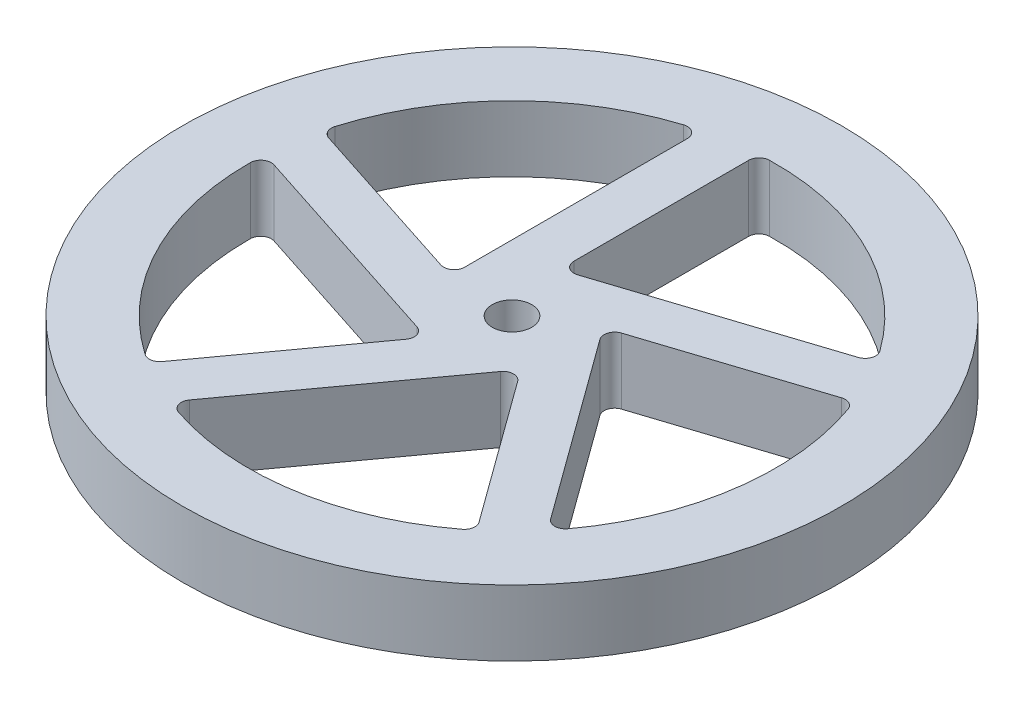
from build123d import *

# Parameters (mm, degrees)
SKETCH1_R             = 31.75
BOSS_EXTRUDE1_DEPTH   = 3.175
F_6_CLEARANCE_HOLE1_D = 3.7973
CUT_EXTRUDE1_DEPTH    = 6.35
FILLET1_R             = 1.016


with BuildPart() as part:
    # Sketch1 → Boss-Extrude1 (new, symmetric)
    with BuildSketch(Plane(origin=(0, 0, 0), x_dir=(1, 0, 0), z_dir=(0, 1, 0))):
        with Locations(Location((0, 0, 0), (0, 0, 270))):
            Circle(SKETCH1_R)
    extrude(amount=BOSS_EXTRUDE1_DEPTH, both=True)

    # 6 Clearance Hole1 (through all)
    with Locations(Plane(origin=(0, 3.175, 0), x_dir=(1, 0, 0), z_dir=(0, 1, 0))):
        with Locations((0, 0)):
            Hole(F_6_CLEARANCE_HOLE1_D / 2)

    # Sketch4 → Cut-Extrude1 (cut)
    with BuildSketch(Plane(origin=(0, 3.175, 0), x_dir=(1, 0, 0), z_dir=(0, 1, 0))):
        with BuildLine():
            Line((-24.600172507, 6.323884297), (-6.35, 0.39404379))
            Line((-6.35, 0.39404379), (-6.35, 24.593444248))
            ThreePointArc((-6.35, 24.593444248), (-17.970044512, 17.950974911), (-24.600172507, 6.323884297))
        make_face()
        with BuildLine():
            ThreePointArc((21.427497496, 13.639001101), (11.519342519, 22.637684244), (-1.5875, 25.350342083))
            Line((-1.5875, 25.350342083), (-1.5875, 6.160975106))
            Line((-1.5875, 6.160975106), (21.427497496, 13.639001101))
        make_face()
        with BuildLine():
            ThreePointArc((25.4, 0), (24.950788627, 4.755853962), (23.61904355, 9.343488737))
            Line((23.61904355, 9.343488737), (5.368871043, 3.413648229))
            Line((5.368871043, 3.413648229), (19.592921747, -16.164077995))
            ThreePointArc((19.592921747, -16.164077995), (23.904185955, -8.587775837), (25.4, 0))
        make_face()
        with BuildLine():
            Line((4.905644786, -4.051224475), (-9.318405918, -23.628950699))
            ThreePointArc((-9.318405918, -23.628950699), (3.986753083, -25.085170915), (16.184871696, -19.575748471))
            Line((16.184871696, -19.575748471), (4.905644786, -4.051224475))
        make_face()
        with BuildLine():
            Line((-13.616242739, -21.441966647), (-2.337015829, -5.917442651))
            Line((-2.337015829, -5.917442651), (-25.352013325, 1.560583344))
            ThreePointArc((-25.352013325, 1.560583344), (-22.625440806, -11.543371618), (-13.616242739, -21.441966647))
        make_face()
    extrude(amount=-CUT_EXTRUDE1_DEPTH, mode=Mode.SUBTRACT)

    # Fillet1
    fillet1_edges = [part.edges().sort_by_distance(p)[0] for p in [
        (-6.35, 0, -24.593444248),
        (-6.35, 0, -0.39404379),
        (-24.600172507, 0, -6.323884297),
        (21.427497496, 0, -13.639001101),
        (-1.5875, 0, -6.160975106),
        (-1.5875, 0, -25.350342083),
        (19.592921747, 0, 16.164077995),
        (5.368871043, 0, -3.413648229),
        (23.61904355, 0, -9.343488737),
        (-9.318405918, 0, 23.628950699),
        (4.905644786, 0, 4.051224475),
        (16.184871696, 0, 19.575748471),
        (-25.352013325, 0, -1.560583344),
        (-2.337015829, 0, 5.917442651),
        (-13.616242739, 0, 21.441966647),
    ]]
    fillet(fillet1_edges, radius=FILLET1_R)


solid = part.part
